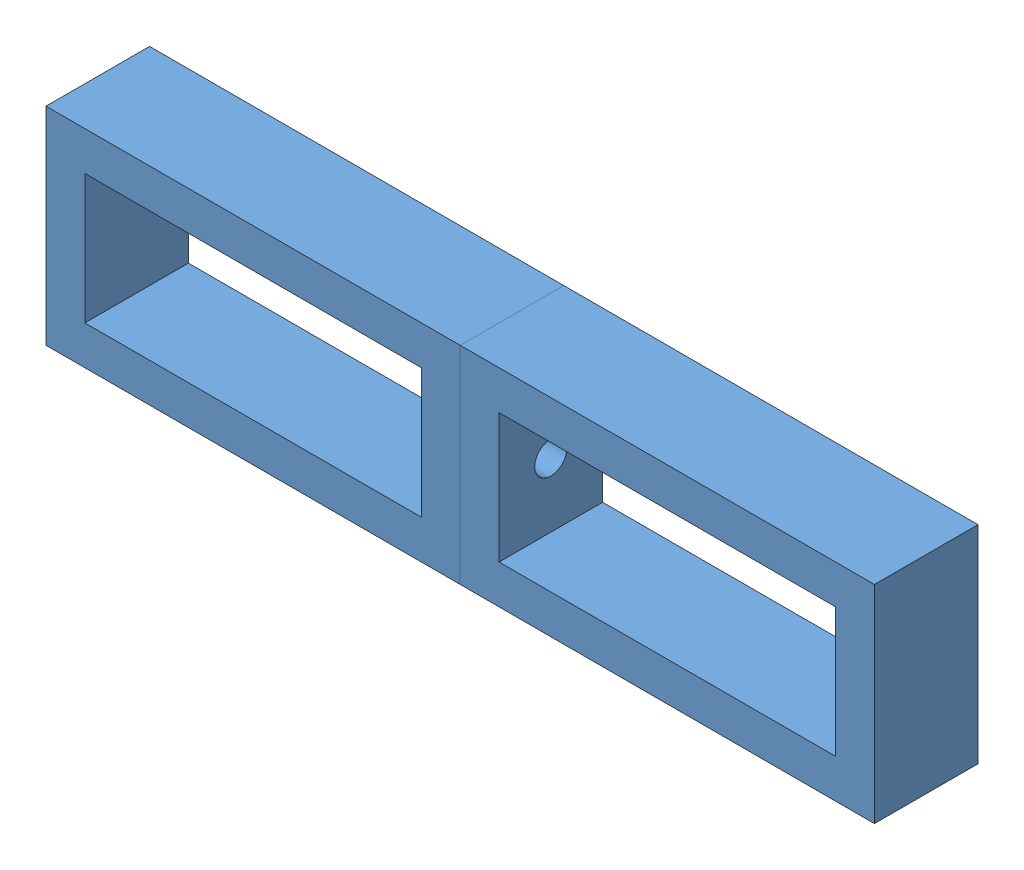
SolidWorks assembly Bolts Assem.SLDASM, configuration Default (file format 11000). Lengths in mm.
Overall size (406.4 101.6 50.8).
2 component instances, 1 part files, 4 mates.
Components (placement in the parent):
- bc1-1: bc1.SLDPRT [Default] at origin size (203.2 101.6 50.8)
- bc1-2: bc1.SLDPRT [Default] at (0 0 50.8) x (-1 0 0) z (0 0 -1) size (203.2 101.6 50.8)
Mates (geometry in assembly coordinates):
- Coincident1: coordinate: point of bc1-1; point of assembly
- Coincident2: coincident: plane of bc1-1 through (0 0 0) normal (0 0 1); plane of assembly through (0 0 0) normal (0 0 1)
- Concentric2: concentric: circle of bc1-1; circle of bc1-2
- Coincident10: coincident: point of bc1-1; point of bc1-2
